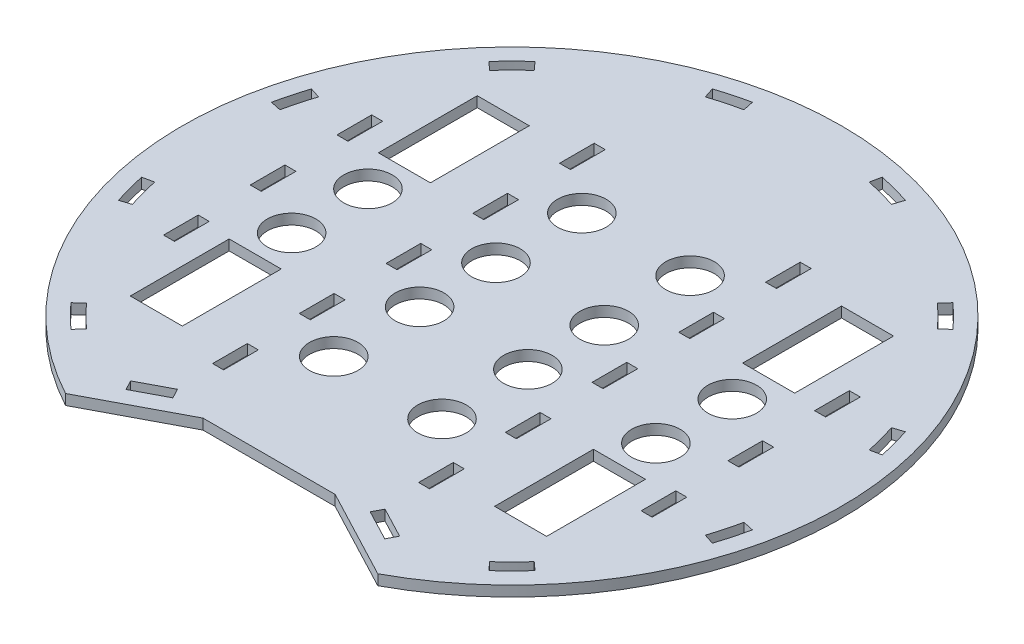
from build123d import *

# Parameters (mm, degrees)
SKETCH1_R           = 13.9895
SKETCH1_W           = 30
SKETCH1_H           = 57
SKETCH1_W_2         = 6.35
SKETCH1_H_2         = 20
BOSS_EXTRUDE1_DEPTH = 6


with BuildPart() as part:
    # Sketch1 → Boss-Extrude1 (new body)
    with BuildSketch(Plane(origin=(0, 0, 0), x_dir=(1, 0, 0), z_dir=(0, 1, 0))):
        with BuildLine():
            Line((-90, -167.332005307), (-38.1, -140))
            Line((-38.1, -140), (38.1, -140))
            Line((38.1, -140), (90, -167.332005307))
            ThreePointArc((90, -167.332005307), (0, 190), (-90, -167.332005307))
        make_face()
        with Locations(Location((-105, -22.009925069, 0), (0, 0, 270))):
            Circle(SKETCH1_R, mode=Mode.SUBTRACT)
        with Locations(Location((-105, 22.009925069, 0), (0, 0, 270))):
            Circle(SKETCH1_R, mode=Mode.SUBTRACT)
        with Locations(Location((105, 22.009925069, 0), (0, 0, 270))):
            Circle(SKETCH1_R, mode=Mode.SUBTRACT)
        with Locations(Location((105, -22.009925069, 0), (0, 0, 270))):
            Circle(SKETCH1_R, mode=Mode.SUBTRACT)
        with Locations(Location((-31.203328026, 22.009925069, 0), (0, 0, 270))):
            Circle(SKETCH1_R, mode=Mode.SUBTRACT)
        with Locations(Location((-31.203328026, 71.509925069, 0), (0, 0, 270))):
            Circle(SKETCH1_R, mode=Mode.SUBTRACT)
        with Locations(Location((-31.203328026, -22.009925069, 0), (0, 0, 270))):
            Circle(SKETCH1_R, mode=Mode.SUBTRACT)
        with Locations(Location((-31.203328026, -71.509925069, 0), (0, 0, 270))):
            Circle(SKETCH1_R, mode=Mode.SUBTRACT)
        with Locations(Location((31.203328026, -71.509925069, 0), (0, 0, 270))):
            Circle(SKETCH1_R, mode=Mode.SUBTRACT)
        with Locations(Location((31.203328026, -22.009925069, 0), (0, 0, 270))):
            Circle(SKETCH1_R, mode=Mode.SUBTRACT)
        with Locations(Location((31.203328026, 71.509925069, 0), (0, 0, 270))):
            Circle(SKETCH1_R, mode=Mode.SUBTRACT)
        with Locations(Location((31.203328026, 22.009925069, 0), (0, 0, 270))):
            Circle(SKETCH1_R, mode=Mode.SUBTRACT)
        with Locations((-105, -71.509925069)):
            Rectangle(SKETCH1_W, SKETCH1_H, mode=Mode.SUBTRACT)
        with Locations((-105, 71.509925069)):
            Rectangle(SKETCH1_W, SKETCH1_H, mode=Mode.SUBTRACT)
        with Locations((105, 71.509925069)):
            Rectangle(SKETCH1_W, SKETCH1_H, mode=Mode.SUBTRACT)
        with Locations((105, -71.509925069)):
            Rectangle(SKETCH1_W, SKETCH1_H, mode=Mode.SUBTRACT)
        with Locations((137.675, -50)):
            Rectangle(SKETCH1_W_2, SKETCH1_H_2, mode=Mode.SUBTRACT)
        with Locations((-137.675, 50)):
            Rectangle(SKETCH1_W_2, SKETCH1_H_2, mode=Mode.SUBTRACT)
        with Locations((-137.675, 0)):
            Rectangle(SKETCH1_W_2, SKETCH1_H_2, mode=Mode.SUBTRACT)
        with Locations((-137.675, -50)):
            Rectangle(SKETCH1_W_2, SKETCH1_H_2, mode=Mode.SUBTRACT)
        with Locations((137.675, 0)):
            Rectangle(SKETCH1_W_2, SKETCH1_H_2, mode=Mode.SUBTRACT)
        with Locations((137.675, 50)):
            Rectangle(SKETCH1_W_2, SKETCH1_H_2, mode=Mode.SUBTRACT)
        with BuildLine():
            Line((-53.660801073, 165.150964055), (-55.623058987, 171.190172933))
            ThreePointArc((-55.623058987, 171.190172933), (-46.587428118, 173.866648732), (-37.424104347, 176.066568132))
            Line((-37.424104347, 176.066568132), (-36.103865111, 169.855330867))
            ThreePointArc((-36.103865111, 169.855330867), (-44.943927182, 167.733019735), (-53.660801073, 165.150964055))
        make_face(mode=Mode.SUBTRACT)
        with BuildLine():
            Line((-120.443509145, 133.766068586), (-116.194529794, 129.047098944))
            ThreePointArc((-116.194529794, 129.047098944), (-122.789092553, 122.789092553), (-129.047098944, 116.194529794))
            Line((-129.047098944, 116.194529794), (-133.766068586, 120.443509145))
            ThreePointArc((-133.766068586, 120.443509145), (-127.279220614, 127.279220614), (-120.443509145, 133.766068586))
        make_face(mode=Mode.SUBTRACT)
        with BuildLine():
            Line((-171.190172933, 55.623058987), (-165.150964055, 53.660801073))
            ThreePointArc((-165.150964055, 53.660801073), (-167.733019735, 44.943927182), (-169.855330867, 36.103865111))
            Line((-169.855330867, 36.103865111), (-176.066568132, 37.424104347))
            ThreePointArc((-176.066568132, 37.424104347), (-173.866648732, 46.587428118), (-171.190172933, 55.623058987))
        make_face(mode=Mode.SUBTRACT)
        with BuildLine():
            Line((-176.066568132, -37.424104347), (-169.855330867, -36.103865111))
            ThreePointArc((-169.855330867, -36.103865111), (-167.733019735, -44.943927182), (-165.150964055, -53.660801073))
            Line((-165.150964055, -53.660801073), (-171.190172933, -55.623058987))
            ThreePointArc((-171.190172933, -55.623058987), (-173.866648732, -46.587428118), (-176.066568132, -37.424104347))
        make_face(mode=Mode.SUBTRACT)
        with BuildLine():
            Line((-133.766068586, -120.443509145), (-129.047098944, -116.194529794))
            ThreePointArc((-129.047098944, -116.194529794), (-122.789092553, -122.789092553), (-116.194529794, -129.047098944))
            Line((-116.194529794, -129.047098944), (-120.443509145, -133.766068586))
            ThreePointArc((-120.443509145, -133.766068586), (-127.279220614, -127.279220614), (-133.766068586, -120.443509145))
        make_face(mode=Mode.SUBTRACT)
        with Locations((59.378328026, 0)):
            Rectangle(SKETCH1_W_2, SKETCH1_H_2, mode=Mode.SUBTRACT)
        with BuildLine():
            Line((116.194529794, -129.047098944), (120.443509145, -133.766068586))
            ThreePointArc((120.443509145, -133.766068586), (127.279220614, -127.279220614), (133.766068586, -120.443509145))
            Line((133.766068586, -120.443509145), (129.047098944, -116.194529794))
            ThreePointArc((129.047098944, -116.194529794), (122.789092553, -122.789092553), (116.194529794, -129.047098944))
        make_face(mode=Mode.SUBTRACT)
        with BuildLine():
            Line((165.150964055, -53.660801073), (171.190172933, -55.623058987))
            ThreePointArc((171.190172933, -55.623058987), (173.866648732, -46.587428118), (176.066568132, -37.424104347))
            Line((176.066568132, -37.424104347), (169.855330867, -36.103865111))
            ThreePointArc((169.855330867, -36.103865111), (167.733019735, -44.943927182), (165.150964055, -53.660801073))
        make_face(mode=Mode.SUBTRACT)
        with BuildLine():
            Line((169.855330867, 36.103865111), (176.066568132, 37.424104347))
            ThreePointArc((176.066568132, 37.424104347), (173.866648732, 46.587428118), (171.190172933, 55.623058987))
            Line((171.190172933, 55.623058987), (165.150964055, 53.660801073))
            ThreePointArc((165.150964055, 53.660801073), (167.733019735, 44.943927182), (169.855330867, 36.103865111))
        make_face(mode=Mode.SUBTRACT)
        with BuildLine():
            Line((129.047098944, 116.194529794), (133.766068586, 120.443509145))
            ThreePointArc((133.766068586, 120.443509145), (127.279220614, 127.279220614), (120.443509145, 133.766068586))
            Line((120.443509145, 133.766068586), (116.194529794, 129.047098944))
            ThreePointArc((116.194529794, 129.047098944), (122.789092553, 122.789092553), (129.047098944, 116.194529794))
        make_face(mode=Mode.SUBTRACT)
        with BuildLine():
            Line((37.424104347, 176.066568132), (36.103865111, 169.855330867))
            ThreePointArc((36.103865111, 169.855330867), (44.943927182, 167.733019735), (53.660801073, 165.150964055))
            Line((53.660801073, 165.150964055), (55.623058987, 171.190172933))
            ThreePointArc((55.623058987, 171.190172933), (46.587428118, 173.866648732), (37.424104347, 176.066568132))
        make_face(mode=Mode.SUBTRACT)
        Polygon((-56.879281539, -138.587765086), (-59.838145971, -132.969258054), (-77.534231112, -142.288516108), (-74.57536668, -147.90702314), align=None, mode=Mode.SUBTRACT)
        Polygon((77.534231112, -142.288516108), (74.57536668, -147.90702314), (56.879281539, -138.587765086), (59.838145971, -132.969258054), align=None, mode=Mode.SUBTRACT)
        with Locations((-59.378328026, 50)):
            Rectangle(SKETCH1_W_2, SKETCH1_H_2, mode=Mode.SUBTRACT)
        with Locations((-59.378328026, 0)):
            Rectangle(SKETCH1_W_2, SKETCH1_H_2, mode=Mode.SUBTRACT)
        with Locations((-59.378328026, 100)):
            Rectangle(SKETCH1_W_2, SKETCH1_H_2, mode=Mode.SUBTRACT)
        with Locations((-59.378328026, -50)):
            Rectangle(SKETCH1_W_2, SKETCH1_H_2, mode=Mode.SUBTRACT)
        with Locations((-59.378328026, -100)):
            Rectangle(SKETCH1_W_2, SKETCH1_H_2, mode=Mode.SUBTRACT)
        with Locations((59.378328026, -50)):
            Rectangle(SKETCH1_W_2, SKETCH1_H_2, mode=Mode.SUBTRACT)
        with Locations((59.378328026, -100)):
            Rectangle(SKETCH1_W_2, SKETCH1_H_2, mode=Mode.SUBTRACT)
        with Locations((59.378328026, 100)):
            Rectangle(SKETCH1_W_2, SKETCH1_H_2, mode=Mode.SUBTRACT)
        with Locations((59.378328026, 50)):
            Rectangle(SKETCH1_W_2, SKETCH1_H_2, mode=Mode.SUBTRACT)
    extrude(amount=BOSS_EXTRUDE1_DEPTH)


solid = part.part
